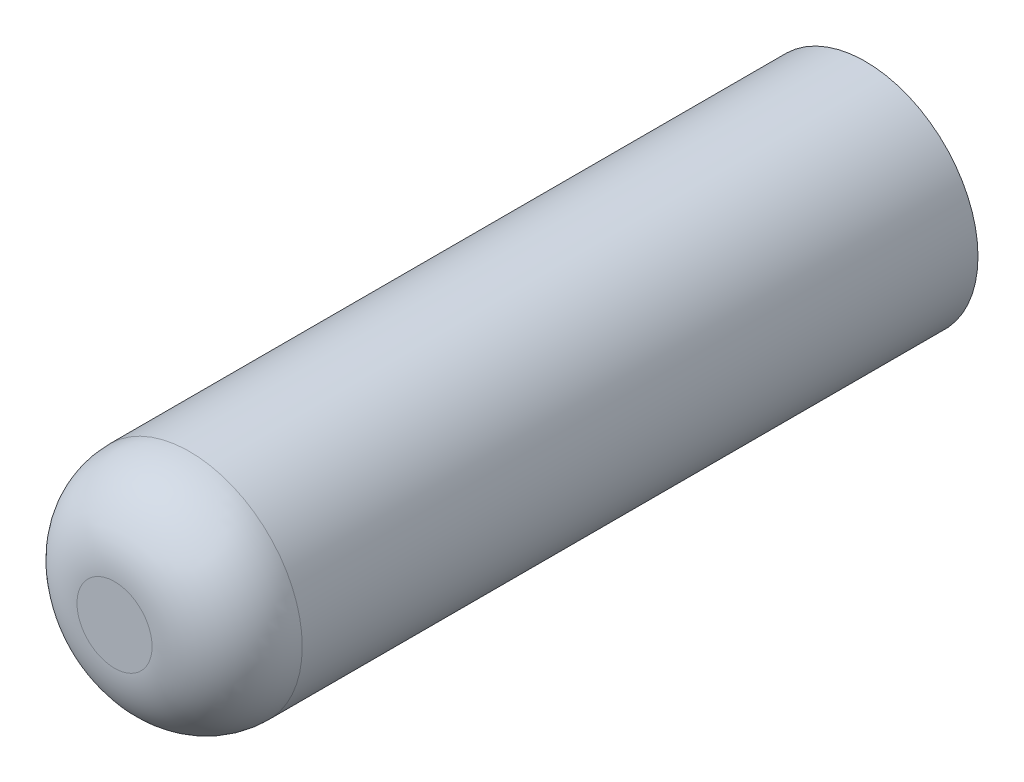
ISO-10303-21;
HEADER;
FILE_DESCRIPTION(('STEP AP214'),'2;1');
FILE_NAME('part.step','',(''),(''),'','','');
FILE_SCHEMA(('AUTOMOTIVE_DESIGN { 1 0 10303 214 1 1 1 1 }'));
ENDSEC;
DATA;
#1=APPLICATION_CONTEXT('core data for automotive mechanical design processes');
#2=APPLICATION_PROTOCOL_DEFINITION('international standard','automotive_design',2000,#1);
#3=PRODUCT_CONTEXT('',#1,'mechanical');
#4=PRODUCT('Part','Part','',(#3));
#5=PRODUCT_RELATED_PRODUCT_CATEGORY('part','',(#4));
#6=PRODUCT_DEFINITION_FORMATION('','',#4);
#7=PRODUCT_DEFINITION_CONTEXT('part definition',#1,'design');
#8=PRODUCT_DEFINITION('design','',#6,#7);
#9=PRODUCT_DEFINITION_SHAPE('','',#8);
#10=(LENGTH_UNIT() NAMED_UNIT(*) SI_UNIT(.MILLI.,.METRE.));
#11=(NAMED_UNIT(*) PLANE_ANGLE_UNIT() SI_UNIT($,.RADIAN.));
#12=(NAMED_UNIT(*) SI_UNIT($,.STERADIAN.) SOLID_ANGLE_UNIT());
#13=UNCERTAINTY_MEASURE_WITH_UNIT(LENGTH_MEASURE(1.E-05),#10,'distance_accuracy_value','');
#14=(GEOMETRIC_REPRESENTATION_CONTEXT(3) GLOBAL_UNCERTAINTY_ASSIGNED_CONTEXT((#13)) GLOBAL_UNIT_ASSIGNED_CONTEXT((#10,
#11,#12)) REPRESENTATION_CONTEXT('',''));
#15=CARTESIAN_POINT('',(0.,0.,0.));
#16=DIRECTION('',(0.,0.,1.));
#17=DIRECTION('',(1.,0.,0.));
#18=AXIS2_PLACEMENT_3D('',#15,#16,#17);
#19=CARTESIAN_POINT('',(0.,0.,20.));
#20=DIRECTION('',(0.,0.,-1.));
#21=DIRECTION('',(-1.,0.,0.));
#22=AXIS2_PLACEMENT_3D('',#19,#20,#21);
#23=CYLINDRICAL_SURFACE('',#22,3.);
#24=CARTESIAN_POINT('',(0.,0.,18.));
#25=DIRECTION('',(0.,0.,1.));
#26=DIRECTION('',(1.,0.,0.));
#27=AXIS2_PLACEMENT_3D('',#24,#25,#26);
#28=CIRCLE('',#27,3.);
#29=CARTESIAN_POINT('',(3.,0.,18.));
#30=VERTEX_POINT('',#29);
#31=EDGE_CURVE('E10',#30,#30,#28,.F.);
#32=ORIENTED_EDGE('',*,*,#31,.T.);
#33=EDGE_LOOP('',(#32));
#34=FACE_BOUND('',#33,.T.);
#35=CARTESIAN_POINT('',(0.,0.,0.));
#36=DIRECTION('',(0.,0.,1.));
#37=DIRECTION('',(1.,0.,0.));
#38=AXIS2_PLACEMENT_3D('',#35,#36,#37);
#39=CIRCLE('',#38,3.);
#40=CARTESIAN_POINT('',(3.,0.,0.));
#41=VERTEX_POINT('',#40);
#42=EDGE_CURVE('E41',#41,#41,#39,.T.);
#43=ORIENTED_EDGE('',*,*,#42,.T.);
#44=EDGE_LOOP('',(#43));
#45=FACE_BOUND('',#44,.T.);
#46=ADVANCED_FACE('F30',(#34,#45),#23,.T.);
#47=CARTESIAN_POINT('',(0.,0.,20.));
#48=DIRECTION('',(0.,0.,1.));
#49=DIRECTION('',(1.,0.,0.));
#50=AXIS2_PLACEMENT_3D('',#47,#48,#49);
#51=PLANE('',#50);
#52=CARTESIAN_POINT('',(0.,0.,20.));
#53=DIRECTION('',(0.,0.,1.));
#54=DIRECTION('',(1.,0.,0.));
#55=AXIS2_PLACEMENT_3D('',#52,#53,#54);
#56=CIRCLE('',#55,1.);
#57=CARTESIAN_POINT('',(1.,0.,20.));
#58=VERTEX_POINT('',#57);
#59=EDGE_CURVE('E37',#58,#58,#56,.T.);
#60=ORIENTED_EDGE('',*,*,#59,.T.);
#61=EDGE_LOOP('',(#60));
#62=FACE_BOUND('',#61,.T.);
#63=ADVANCED_FACE('F65',(#62),#51,.T.);
#64=CARTESIAN_POINT('',(0.,0.,0.));
#65=DIRECTION('',(0.,0.,1.));
#66=DIRECTION('',(1.,0.,0.));
#67=AXIS2_PLACEMENT_3D('',#64,#65,#66);
#68=PLANE('',#67);
#69=CARTESIAN_POINT('',(0.,0.,0.));
#70=DIRECTION('',(0.,0.,-1.));
#71=DIRECTION('',(-1.,0.,0.));
#72=AXIS2_PLACEMENT_3D('',#69,#70,#71);
#73=CIRCLE('',#72,1.5);
#74=CARTESIAN_POINT('',(-1.5,0.,0.));
#75=VERTEX_POINT('',#74);
#76=EDGE_CURVE('E48',#75,#75,#73,.T.);
#77=ORIENTED_EDGE('',*,*,#76,.F.);
#78=EDGE_LOOP('',(#77));
#79=FACE_BOUND('',#78,.T.);
#80=ORIENTED_EDGE('',*,*,#42,.F.);
#81=EDGE_LOOP('',(#80));
#82=FACE_BOUND('',#81,.T.);
#83=ADVANCED_FACE('F59',(#79,#82),#68,.F.);
#84=CARTESIAN_POINT('',(0.,0.,8.5));
#85=DIRECTION('',(0.,0.,-1.));
#86=DIRECTION('',(-1.,0.,0.));
#87=AXIS2_PLACEMENT_3D('',#84,#85,#86);
#88=CYLINDRICAL_SURFACE('',#87,1.5);
#89=CARTESIAN_POINT('',(0.,0.,8.5));
#90=DIRECTION('',(0.,0.,-1.));
#91=DIRECTION('',(-1.,0.,0.));
#92=AXIS2_PLACEMENT_3D('',#89,#90,#91);
#93=CIRCLE('',#92,1.5);
#94=CARTESIAN_POINT('',(-1.5,0.,8.5));
#95=VERTEX_POINT('',#94);
#96=EDGE_CURVE('E45',#95,#95,#93,.T.);
#97=ORIENTED_EDGE('',*,*,#96,.F.);
#98=EDGE_LOOP('',(#97));
#99=FACE_BOUND('',#98,.T.);
#100=ORIENTED_EDGE('',*,*,#76,.T.);
#101=EDGE_LOOP('',(#100));
#102=FACE_BOUND('',#101,.T.);
#103=ADVANCED_FACE('F56',(#99,#102),#88,.F.);
#104=CARTESIAN_POINT('',(0.,0.,8.5));
#105=DIRECTION('',(0.,0.,-1.));
#106=DIRECTION('',(-1.,0.,0.));
#107=AXIS2_PLACEMENT_3D('',#104,#105,#106);
#108=PLANE('',#107);
#109=ORIENTED_EDGE('',*,*,#96,.T.);
#110=EDGE_LOOP('',(#109));
#111=FACE_BOUND('',#110,.T.);
#112=ADVANCED_FACE('F54',(#111),#108,.T.);
#113=CARTESIAN_POINT('',(0.,0.,18.));
#114=DIRECTION('',(0.,0.,1.));
#115=DIRECTION('',(1.,0.,0.));
#116=AXIS2_PLACEMENT_3D('',#113,#114,#115);
#117=DEGENERATE_TOROIDAL_SURFACE('',#116,1.,2.,.T.);
#118=ORIENTED_EDGE('',*,*,#31,.F.);
#119=EDGE_LOOP('',(#118));
#120=FACE_BOUND('',#119,.T.);
#121=ORIENTED_EDGE('',*,*,#59,.F.);
#122=EDGE_LOOP('',(#121));
#123=FACE_BOUND('',#122,.T.);
#124=ADVANCED_FACE('F32',(#120,#123),#117,.T.);
#125=CLOSED_SHELL('',(#46,#63,#83,#103,#112,#124));
#126=MANIFOLD_SOLID_BREP('B2',#125);
#127=ADVANCED_BREP_SHAPE_REPRESENTATION('',(#18,#126),#14);
#128=SHAPE_DEFINITION_REPRESENTATION(#9,#127);
ENDSEC;
END-ISO-10303-21;
